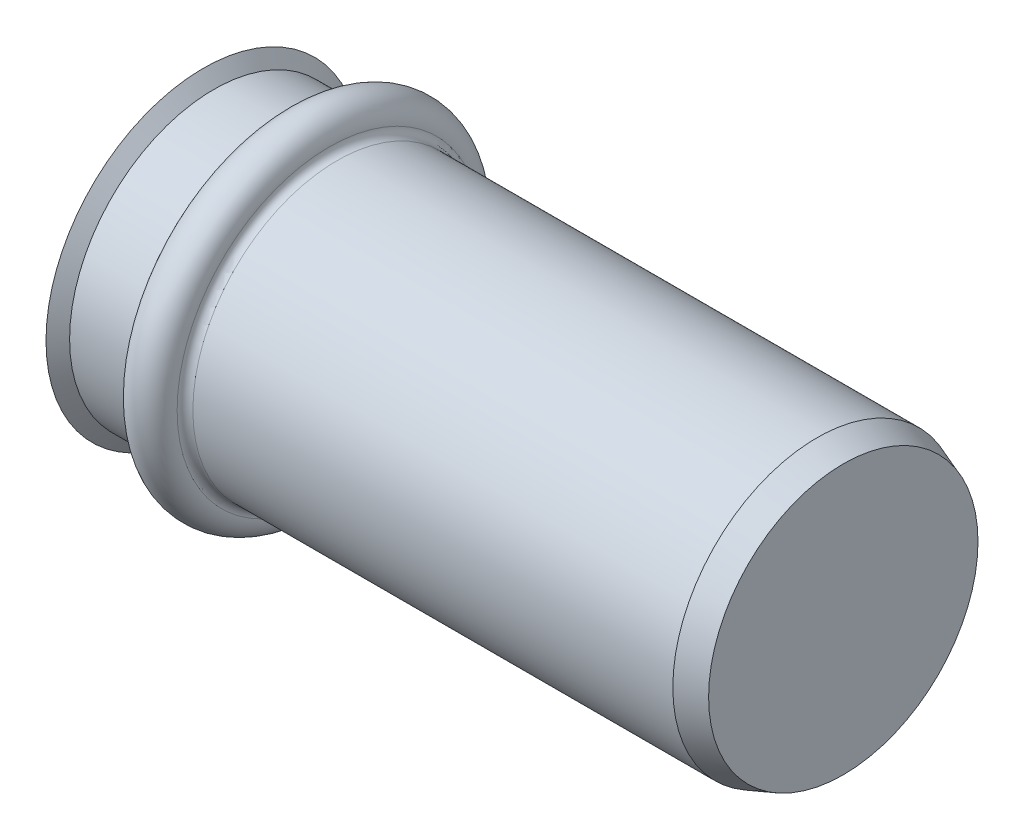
ISO-10303-21;
HEADER;
FILE_DESCRIPTION(('STEP AP214'),'2;1');
FILE_NAME('part.step','',(''),(''),'','','');
FILE_SCHEMA(('AUTOMOTIVE_DESIGN { 1 0 10303 214 1 1 1 1 }'));
ENDSEC;
DATA;
#1=APPLICATION_CONTEXT('core data for automotive mechanical design processes');
#2=APPLICATION_PROTOCOL_DEFINITION('international standard','automotive_design',2000,#1);
#3=PRODUCT_CONTEXT('',#1,'mechanical');
#4=PRODUCT('Part','Part','',(#3));
#5=PRODUCT_RELATED_PRODUCT_CATEGORY('part','',(#4));
#6=PRODUCT_DEFINITION_FORMATION('','',#4);
#7=PRODUCT_DEFINITION_CONTEXT('part definition',#1,'design');
#8=PRODUCT_DEFINITION('design','',#6,#7);
#9=PRODUCT_DEFINITION_SHAPE('','',#8);
#10=(LENGTH_UNIT() NAMED_UNIT(*) SI_UNIT(.MILLI.,.METRE.));
#11=(NAMED_UNIT(*) PLANE_ANGLE_UNIT() SI_UNIT($,.RADIAN.));
#12=(NAMED_UNIT(*) SI_UNIT($,.STERADIAN.) SOLID_ANGLE_UNIT());
#13=UNCERTAINTY_MEASURE_WITH_UNIT(LENGTH_MEASURE(1.E-05),#10,'distance_accuracy_value','');
#14=(GEOMETRIC_REPRESENTATION_CONTEXT(3) GLOBAL_UNCERTAINTY_ASSIGNED_CONTEXT((#13)) GLOBAL_UNIT_ASSIGNED_CONTEXT((#10,
#11,#12)) REPRESENTATION_CONTEXT('',''));
#15=CARTESIAN_POINT('',(0.,0.,0.));
#16=DIRECTION('',(0.,0.,1.));
#17=DIRECTION('',(1.,0.,0.));
#18=AXIS2_PLACEMENT_3D('',#15,#16,#17);
#19=CARTESIAN_POINT('',(21.5800000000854,0.,0.));
#20=DIRECTION('',(-1.,0.,0.));
#21=DIRECTION('',(0.,0.,1.));
#22=AXIS2_PLACEMENT_3D('',#19,#20,#21);
#23=CONICAL_SURFACE('',#22,3.15874999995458,1.04719755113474);
#24=CARTESIAN_POINT('',(23.4037051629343,8.5265128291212E-11,0.));
#25=VERTEX_POINT('',#24);
#26=VERTEX_LOOP('',#25);
#27=FACE_BOUND('',#26,.T.);
#28=CARTESIAN_POINT('',(21.58,0.,0.));
#29=DIRECTION('',(1.,0.,0.));
#30=DIRECTION('',(0.,0.,-1.));
#31=AXIS2_PLACEMENT_3D('',#28,#29,#30);
#32=CIRCLE('',#31,3.15875);
#33=CARTESIAN_POINT('',(21.58,0.,-3.15875));
#34=VERTEX_POINT('',#33);
#35=EDGE_CURVE('E68',#34,#34,#32,.F.);
#36=ORIENTED_EDGE('',*,*,#35,.T.);
#37=EDGE_LOOP('',(#36));
#38=FACE_BOUND('',#37,.T.);
#39=ADVANCED_FACE('F34',(#27,#38),#23,.F.);
#40=CARTESIAN_POINT('',(20.102375,0.,0.));
#41=DIRECTION('',(1.,0.,0.));
#42=DIRECTION('',(0.,0.,-1.));
#43=AXIS2_PLACEMENT_3D('',#40,#41,#42);
#44=CYLINDRICAL_SURFACE('',#43,3.15875);
#45=CARTESIAN_POINT('',(18.6247499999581,0.,0.));
#46=DIRECTION('',(-1.,0.,0.));
#47=DIRECTION('',(0.,1.,0.));
#48=AXIS2_PLACEMENT_3D('',#45,#46,#47);
#49=CIRCLE('',#48,3.15874999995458);
#50=CARTESIAN_POINT('',(18.6247499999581,3.15874999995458,0.));
#51=VERTEX_POINT('',#50);
#52=EDGE_CURVE('E70',#51,#51,#49,.T.);
#53=ORIENTED_EDGE('',*,*,#52,.T.);
#54=EDGE_LOOP('',(#53));
#55=FACE_BOUND('',#54,.T.);
#56=ORIENTED_EDGE('',*,*,#35,.F.);
#57=EDGE_LOOP('',(#56));
#58=FACE_BOUND('',#57,.T.);
#59=ADVANCED_FACE('F65',(#55,#58),#44,.F.);
#60=CARTESIAN_POINT('',(18.4600000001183,0.,0.));
#61=DIRECTION('',(-1.,0.,0.));
#62=DIRECTION('',(0.,0.,1.));
#63=AXIS2_PLACEMENT_3D('',#60,#61,#62);
#64=CONICAL_SURFACE('',#63,3.32349999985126,0.785398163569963);
#65=CARTESIAN_POINT('',(18.46,0.,0.));
#66=DIRECTION('',(1.,0.,0.));
#67=DIRECTION('',(0.,0.,-1.));
#68=AXIS2_PLACEMENT_3D('',#65,#66,#67);
#69=CIRCLE('',#68,3.3235);
#70=CARTESIAN_POINT('',(18.46,0.,-3.3235));
#71=VERTEX_POINT('',#70);
#72=EDGE_CURVE('E73',#71,#71,#69,.F.);
#73=ORIENTED_EDGE('',*,*,#72,.T.);
#74=EDGE_LOOP('',(#73));
#75=FACE_BOUND('',#74,.T.);
#76=ORIENTED_EDGE('',*,*,#52,.F.);
#77=EDGE_LOOP('',(#76));
#78=FACE_BOUND('',#77,.T.);
#79=ADVANCED_FACE('F156',(#75,#78),#64,.F.);
#80=CARTESIAN_POINT('',(11.51825,0.,0.));
#81=DIRECTION('',(1.,0.,0.));
#82=DIRECTION('',(0.,0.,-1.));
#83=AXIS2_PLACEMENT_3D('',#80,#81,#82);
#84=CYLINDRICAL_SURFACE('',#83,3.3235);
#85=CARTESIAN_POINT('',(4.66585513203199,0.,0.));
#86=DIRECTION('',(-1.,0.,0.));
#87=DIRECTION('',(0.,1.,0.));
#88=AXIS2_PLACEMENT_3D('',#85,#86,#87);
#89=CIRCLE('',#88,3.3235000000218);
#90=CARTESIAN_POINT('',(4.66585513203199,3.3235000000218,0.));
#91=VERTEX_POINT('',#90);
#92=EDGE_CURVE('E151',#91,#91,#89,.T.);
#93=ORIENTED_EDGE('',*,*,#92,.T.);
#94=EDGE_LOOP('',(#93));
#95=FACE_BOUND('',#94,.T.);
#96=ORIENTED_EDGE('',*,*,#72,.F.);
#97=EDGE_LOOP('',(#96));
#98=FACE_BOUND('',#97,.T.);
#99=ADVANCED_FACE('F159',(#95,#98),#84,.F.);
#100=CARTESIAN_POINT('',(3.89999999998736,0.,0.));
#101=DIRECTION('',(-1.,0.,0.));
#102=DIRECTION('',(0.,0.,1.));
#103=AXIS2_PLACEMENT_3D('',#100,#101,#102);
#104=CONICAL_SURFACE('',#103,4.64999999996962,1.04719755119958);
#105=CARTESIAN_POINT('',(3.9,0.,0.));
#106=DIRECTION('',(-1.,0.,0.));
#107=DIRECTION('',(0.,0.,1.));
#108=AXIS2_PLACEMENT_3D('',#105,#106,#107);
#109=CIRCLE('',#108,4.65);
#110=CARTESIAN_POINT('',(3.9,0.,4.65));
#111=VERTEX_POINT('',#110);
#112=EDGE_CURVE('E91',#111,#111,#109,.T.);
#113=ORIENTED_EDGE('',*,*,#112,.T.);
#114=EDGE_LOOP('',(#113));
#115=FACE_BOUND('',#114,.T.);
#116=ORIENTED_EDGE('',*,*,#92,.F.);
#117=EDGE_LOOP('',(#116));
#118=FACE_BOUND('',#117,.T.);
#119=ADVANCED_FACE('F161',(#115,#118),#104,.F.);
#120=CARTESIAN_POINT('',(-0.100000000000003,0.,0.));
#121=DIRECTION('',(-1.,0.,0.));
#122=DIRECTION('',(0.,0.,1.));
#123=AXIS2_PLACEMENT_3D('',#120,#121,#122);
#124=CYLINDRICAL_SURFACE('',#123,4.65);
#125=ORIENTED_EDGE('',*,*,#112,.F.);
#126=EDGE_LOOP('',(#125));
#127=FACE_BOUND('',#126,.T.);
#128=CARTESIAN_POINT('',(-0.100000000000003,0.,0.));
#129=DIRECTION('',(-1.,0.,0.));
#130=DIRECTION('',(0.,0.,1.));
#131=AXIS2_PLACEMENT_3D('',#128,#129,#130);
#132=CIRCLE('',#131,4.65);
#133=CARTESIAN_POINT('',(-0.100000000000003,0.,4.65));
#134=VERTEX_POINT('',#133);
#135=EDGE_CURVE('E88',#134,#134,#132,.T.);
#136=ORIENTED_EDGE('',*,*,#135,.T.);
#137=EDGE_LOOP('',(#136));
#138=FACE_BOUND('',#137,.T.);
#139=ADVANCED_FACE('F168',(#127,#138),#124,.F.);
#140=CARTESIAN_POINT('',(-0.100000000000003,0.,0.));
#141=DIRECTION('',(1.,0.,0.));
#142=DIRECTION('',(0.,0.,-1.));
#143=AXIS2_PLACEMENT_3D('',#140,#141,#142);
#144=PLANE('',#143);
#145=ORIENTED_EDGE('',*,*,#135,.F.);
#146=EDGE_LOOP('',(#145));
#147=FACE_BOUND('',#146,.T.);
#148=CARTESIAN_POINT('',(-0.0999999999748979,0.,0.));
#149=DIRECTION('',(-1.,0.,0.));
#150=DIRECTION('',(0.,0.,1.));
#151=AXIS2_PLACEMENT_3D('',#148,#149,#150);
#152=CIRCLE('',#151,5.99999999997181);
#153=CARTESIAN_POINT('',(-0.0999999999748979,0.,5.99999999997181));
#154=VERTEX_POINT('',#153);
#155=EDGE_CURVE('E85',#154,#154,#152,.F.);
#156=ORIENTED_EDGE('',*,*,#155,.F.);
#157=EDGE_LOOP('',(#156));
#158=FACE_BOUND('',#157,.T.);
#159=ADVANCED_FACE('F228',(#147,#158),#144,.F.);
#160=CARTESIAN_POINT('',(-0.0999999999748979,0.,0.));
#161=DIRECTION('',(-1.,0.,0.));
#162=DIRECTION('',(0.,0.,1.));
#163=AXIS2_PLACEMENT_3D('',#160,#161,#162);
#164=CONICAL_SURFACE('',#163,5.99999999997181,0.89605538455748);
#165=ORIENTED_EDGE('',*,*,#155,.T.);
#166=EDGE_LOOP('',(#165));
#167=FACE_BOUND('',#166,.T.);
#168=CARTESIAN_POINT('',(0.299999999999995,0.,0.));
#169=DIRECTION('',(-1.,0.,0.));
#170=DIRECTION('',(0.,0.,1.));
#171=AXIS2_PLACEMENT_3D('',#168,#169,#170);
#172=CIRCLE('',#171,5.5);
#173=CARTESIAN_POINT('',(0.299999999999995,0.,5.5));
#174=VERTEX_POINT('',#173);
#175=EDGE_CURVE('E84',#174,#174,#172,.F.);
#176=ORIENTED_EDGE('',*,*,#175,.F.);
#177=EDGE_LOOP('',(#176));
#178=FACE_BOUND('',#177,.T.);
#179=ADVANCED_FACE('F221',(#167,#178),#164,.T.);
#180=CARTESIAN_POINT('',(0.,0.,0.));
#181=DIRECTION('',(-1.,0.,0.));
#182=DIRECTION('',(0.,0.,1.));
#183=AXIS2_PLACEMENT_3D('',#180,#181,#182);
#184=CYLINDRICAL_SURFACE('',#183,5.5);
#185=ORIENTED_EDGE('',*,*,#175,.T.);
#186=EDGE_LOOP('',(#185));
#187=FACE_BOUND('',#186,.T.);
#188=CARTESIAN_POINT('',(3.,0.,0.));
#189=DIRECTION('',(-1.,0.,0.));
#190=DIRECTION('',(0.,0.,1.));
#191=AXIS2_PLACEMENT_3D('',#188,#189,#190);
#192=CIRCLE('',#191,5.5);
#193=CARTESIAN_POINT('',(3.,0.,5.5));
#194=VERTEX_POINT('',#193);
#195=EDGE_CURVE('E81',#194,#194,#192,.F.);
#196=ORIENTED_EDGE('',*,*,#195,.F.);
#197=EDGE_LOOP('',(#196));
#198=FACE_BOUND('',#197,.T.);
#199=ADVANCED_FACE('F215',(#187,#198),#184,.T.);
#200=CARTESIAN_POINT('',(3.,2.90000000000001,0.));
#201=DIRECTION('',(-1.,0.,0.));
#202=DIRECTION('',(0.,0.,1.));
#203=AXIS2_PLACEMENT_3D('',#200,#201,#202);
#204=PLANE('',#203);
#205=CARTESIAN_POINT('',(3.00000000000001,0.,0.));
#206=DIRECTION('',(1.,0.,0.));
#207=DIRECTION('',(0.,0.,1.));
#208=AXIS2_PLACEMENT_3D('',#205,#206,#207);
#209=CIRCLE('',#208,5.80000000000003);
#210=CARTESIAN_POINT('',(3.,0.,5.80000000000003));
#211=VERTEX_POINT('',#210);
#212=CARTESIAN_POINT('',(3.,0.,-5.80000000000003));
#213=VERTEX_POINT('',#212);
#214=EDGE_CURVE('E53',#211,#213,#209,.T.);
#215=ORIENTED_EDGE('',*,*,#214,.F.);
#216=CARTESIAN_POINT('',(3.00000000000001,0.,0.));
#217=DIRECTION('',(1.,0.,0.));
#218=DIRECTION('',(0.,1.,0.));
#219=AXIS2_PLACEMENT_3D('',#216,#217,#218);
#220=CIRCLE('',#219,5.80000000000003);
#221=CARTESIAN_POINT('',(2.99999999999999,5.80000000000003,0.));
#222=VERTEX_POINT('',#221);
#223=EDGE_CURVE('E93',#222,#211,#220,.T.);
#224=ORIENTED_EDGE('',*,*,#223,.F.);
#225=CARTESIAN_POINT('',(3.00000000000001,0.,0.));
#226=DIRECTION('',(1.,0.,0.));
#227=DIRECTION('',(0.,0.,-1.));
#228=AXIS2_PLACEMENT_3D('',#225,#226,#227);
#229=CIRCLE('',#228,5.80000000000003);
#230=EDGE_CURVE('E121',#213,#222,#229,.T.);
#231=ORIENTED_EDGE('',*,*,#230,.F.);
#232=EDGE_LOOP('',(#215,#224,#231));
#233=FACE_BOUND('',#232,.T.);
#234=ORIENTED_EDGE('',*,*,#195,.T.);
#235=EDGE_LOOP('',(#234));
#236=FACE_BOUND('',#235,.T.);
#237=ADVANCED_FACE('F110',(#233,#236),#204,.T.);
#238=CARTESIAN_POINT('',(3.85000000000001,0.,0.));
#239=DIRECTION('',(-1.,0.,0.));
#240=DIRECTION('',(0.,0.,1.));
#241=AXIS2_PLACEMENT_3D('',#238,#239,#240);
#242=TOROIDAL_SURFACE('',#241,5.80000000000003,0.85);
#243=ORIENTED_EDGE('',*,*,#214,.T.);
#244=ORIENTED_EDGE('',*,*,#230,.T.);
#245=ORIENTED_EDGE('',*,*,#223,.T.);
#246=EDGE_LOOP('',(#243,#244,#245));
#247=FACE_BOUND('',#246,.T.);
#248=CARTESIAN_POINT('',(4.7,0.,0.));
#249=DIRECTION('',(-1.,0.,0.));
#250=DIRECTION('',(0.,0.,1.));
#251=AXIS2_PLACEMENT_3D('',#248,#249,#250);
#252=CIRCLE('',#251,5.8);
#253=CARTESIAN_POINT('',(4.7,0.,5.8));
#254=VERTEX_POINT('',#253);
#255=EDGE_CURVE('E80',#254,#254,#252,.T.);
#256=ORIENTED_EDGE('',*,*,#255,.T.);
#257=EDGE_LOOP('',(#256));
#258=FACE_BOUND('',#257,.T.);
#259=ADVANCED_FACE('F98',(#247,#258),#242,.T.);
#260=CARTESIAN_POINT('',(24.3,0.,0.));
#261=DIRECTION('',(1.,0.,0.));
#262=DIRECTION('',(0.,0.,-1.));
#263=AXIS2_PLACEMENT_3D('',#260,#261,#262);
#264=PLANE('',#263);
#265=CARTESIAN_POINT('',(24.2999999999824,0.,0.));
#266=DIRECTION('',(-1.,0.,0.));
#267=DIRECTION('',(0.,0.,1.));
#268=AXIS2_PLACEMENT_3D('',#265,#266,#267);
#269=CIRCLE('',#268,5.13602976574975);
#270=CARTESIAN_POINT('',(24.2999999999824,0.,5.13602976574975));
#271=VERTEX_POINT('',#270);
#272=EDGE_CURVE('E77',#271,#271,#269,.T.);
#273=ORIENTED_EDGE('',*,*,#272,.F.);
#274=EDGE_LOOP('',(#273));
#275=FACE_BOUND('',#274,.T.);
#276=ADVANCED_FACE('F109',(#275),#264,.T.);
#277=CARTESIAN_POINT('',(5.,0.,0.));
#278=DIRECTION('',(-1.,0.,0.));
#279=DIRECTION('',(0.,0.,1.));
#280=AXIS2_PLACEMENT_3D('',#277,#278,#279);
#281=TOROIDAL_SURFACE('',#280,5.80000000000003,0.299999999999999);
#282=ORIENTED_EDGE('',*,*,#255,.F.);
#283=EDGE_LOOP('',(#282));
#284=FACE_BOUND('',#283,.T.);
#285=CARTESIAN_POINT('',(5.,0.,0.));
#286=DIRECTION('',(-1.,0.,0.));
#287=DIRECTION('',(0.,0.,1.));
#288=AXIS2_PLACEMENT_3D('',#285,#286,#287);
#289=CIRCLE('',#288,5.5);
#290=CARTESIAN_POINT('',(5.,0.,5.5));
#291=VERTEX_POINT('',#290);
#292=EDGE_CURVE('E45',#291,#291,#289,.F.);
#293=ORIENTED_EDGE('',*,*,#292,.F.);
#294=EDGE_LOOP('',(#293));
#295=FACE_BOUND('',#294,.T.);
#296=ADVANCED_FACE('F180',(#284,#295),#281,.F.);
#297=CARTESIAN_POINT('',(23.3000000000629,0.,0.));
#298=DIRECTION('',(-1.,0.,0.));
#299=DIRECTION('',(0.,0.,1.));
#300=AXIS2_PLACEMENT_3D('',#297,#298,#299);
#301=CONICAL_SURFACE('',#300,5.49999999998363,0.349065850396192);
#302=ORIENTED_EDGE('',*,*,#272,.T.);
#303=EDGE_LOOP('',(#302));
#304=FACE_BOUND('',#303,.T.);
#305=CARTESIAN_POINT('',(23.3,0.,0.));
#306=DIRECTION('',(-1.,0.,0.));
#307=DIRECTION('',(0.,0.,1.));
#308=AXIS2_PLACEMENT_3D('',#305,#306,#307);
#309=CIRCLE('',#308,5.5);
#310=CARTESIAN_POINT('',(23.3,0.,5.5));
#311=VERTEX_POINT('',#310);
#312=EDGE_CURVE('E11',#311,#311,#309,.T.);
#313=ORIENTED_EDGE('',*,*,#312,.F.);
#314=EDGE_LOOP('',(#313));
#315=FACE_BOUND('',#314,.T.);
#316=ADVANCED_FACE('F174',(#304,#315),#301,.T.);
#317=CARTESIAN_POINT('',(0.,0.,0.));
#318=DIRECTION('',(-1.,0.,0.));
#319=DIRECTION('',(0.,0.,1.));
#320=AXIS2_PLACEMENT_3D('',#317,#318,#319);
#321=CYLINDRICAL_SURFACE('',#320,5.5);
#322=ORIENTED_EDGE('',*,*,#292,.T.);
#323=EDGE_LOOP('',(#322));
#324=FACE_BOUND('',#323,.T.);
#325=ORIENTED_EDGE('',*,*,#312,.T.);
#326=EDGE_LOOP('',(#325));
#327=FACE_BOUND('',#326,.T.);
#328=ADVANCED_FACE('F172',(#324,#327),#321,.T.);
#329=CLOSED_SHELL('',(#39,#59,#79,#99,#119,#139,#159,#179,#199,#237,#259,#276,#296,#316,#328));
#330=MANIFOLD_SOLID_BREP('B2',#329);
#331=ADVANCED_BREP_SHAPE_REPRESENTATION('',(#18,#330),#14);
#332=SHAPE_DEFINITION_REPRESENTATION(#9,#331);
ENDSEC;
END-ISO-10303-21;
